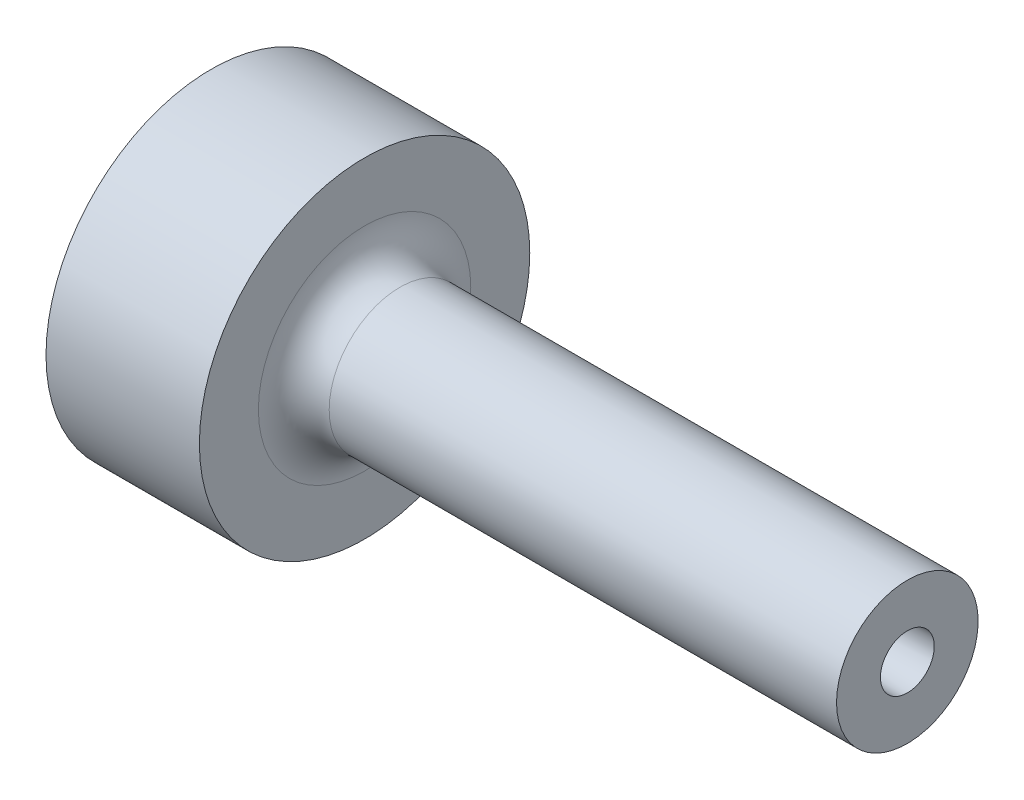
ISO-10303-21;
HEADER;
FILE_DESCRIPTION(('STEP AP214'),'2;1');
FILE_NAME('part.step','',(''),(''),'','','');
FILE_SCHEMA(('AUTOMOTIVE_DESIGN { 1 0 10303 214 1 1 1 1 }'));
ENDSEC;
DATA;
#1=APPLICATION_CONTEXT('core data for automotive mechanical design processes');
#2=APPLICATION_PROTOCOL_DEFINITION('international standard','automotive_design',2000,#1);
#3=PRODUCT_CONTEXT('',#1,'mechanical');
#4=PRODUCT('Part','Part','',(#3));
#5=PRODUCT_RELATED_PRODUCT_CATEGORY('part','',(#4));
#6=PRODUCT_DEFINITION_FORMATION('','',#4);
#7=PRODUCT_DEFINITION_CONTEXT('part definition',#1,'design');
#8=PRODUCT_DEFINITION('design','',#6,#7);
#9=PRODUCT_DEFINITION_SHAPE('','',#8);
#10=(LENGTH_UNIT() NAMED_UNIT(*) SI_UNIT(.MILLI.,.METRE.));
#11=(NAMED_UNIT(*) PLANE_ANGLE_UNIT() SI_UNIT($,.RADIAN.));
#12=(NAMED_UNIT(*) SI_UNIT($,.STERADIAN.) SOLID_ANGLE_UNIT());
#13=UNCERTAINTY_MEASURE_WITH_UNIT(LENGTH_MEASURE(1.E-05),#10,'distance_accuracy_value','');
#14=(GEOMETRIC_REPRESENTATION_CONTEXT(3) GLOBAL_UNCERTAINTY_ASSIGNED_CONTEXT((#13)) GLOBAL_UNIT_ASSIGNED_CONTEXT((#10,
#11,#12)) REPRESENTATION_CONTEXT('',''));
#15=CARTESIAN_POINT('',(0.,0.,0.));
#16=DIRECTION('',(0.,0.,1.));
#17=DIRECTION('',(1.,0.,0.));
#18=AXIS2_PLACEMENT_3D('',#15,#16,#17);
#19=CARTESIAN_POINT('',(0.,0.,0.));
#20=DIRECTION('',(-1.,0.,0.));
#21=DIRECTION('',(0.,0.,1.));
#22=AXIS2_PLACEMENT_3D('',#19,#20,#21);
#23=CYLINDRICAL_SURFACE('',#22,14.);
#24=CARTESIAN_POINT('',(13.,0.,0.));
#25=DIRECTION('',(-1.,0.,0.));
#26=DIRECTION('',(0.,0.,1.));
#27=AXIS2_PLACEMENT_3D('',#24,#25,#26);
#28=CIRCLE('',#27,14.);
#29=CARTESIAN_POINT('',(13.,0.,14.));
#30=VERTEX_POINT('',#29);
#31=EDGE_CURVE('E88',#30,#30,#28,.T.);
#32=ORIENTED_EDGE('',*,*,#31,.T.);
#33=EDGE_LOOP('',(#32));
#34=FACE_BOUND('',#33,.T.);
#35=CARTESIAN_POINT('',(0.,0.,0.));
#36=DIRECTION('',(-1.,0.,0.));
#37=DIRECTION('',(0.,0.,1.));
#38=AXIS2_PLACEMENT_3D('',#35,#36,#37);
#39=CIRCLE('',#38,14.);
#40=CARTESIAN_POINT('',(0.,0.,14.));
#41=VERTEX_POINT('',#40);
#42=EDGE_CURVE('E83',#41,#41,#39,.T.);
#43=ORIENTED_EDGE('',*,*,#42,.F.);
#44=EDGE_LOOP('',(#43));
#45=FACE_BOUND('',#44,.T.);
#46=CARTESIAN_POINT('',(6.5,-13.856406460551,-2.));
#47=CARTESIAN_POINT('',(6.61172417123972,-13.8564082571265,-1.99999534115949));
#48=CARTESIAN_POINT('',(6.72351471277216,-13.8577723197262,-1.99060664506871));
#49=CARTESIAN_POINT('',(6.9439746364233,-13.8630779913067,-1.95330740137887));
#50=CARTESIAN_POINT('',(7.05264079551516,-13.8670221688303,-1.92537839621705));
#51=CARTESIAN_POINT('',(7.26362870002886,-13.8770324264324,-1.85184738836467));
#52=CARTESIAN_POINT('',(7.36595507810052,-13.8830969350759,-1.80625847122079));
#53=CARTESIAN_POINT('',(7.56148972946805,-13.8966626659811,-1.69873175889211));
#54=CARTESIAN_POINT('',(7.65469934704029,-13.9041636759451,-1.63679637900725));
#55=CARTESIAN_POINT('',(7.83004829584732,-13.9198182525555,-1.49785346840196));
#56=CARTESIAN_POINT('',(7.91211171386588,-13.9279757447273,-1.42075056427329));
#57=CARTESIAN_POINT('',(8.06218155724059,-13.9439890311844,-1.25386707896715));
#58=CARTESIAN_POINT('',(8.13018723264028,-13.9518448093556,-1.16408582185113));
#59=CARTESIAN_POINT('',(8.25048909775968,-13.9664103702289,-0.973910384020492));
#60=CARTESIAN_POINT('',(8.30271571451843,-13.9731150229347,-0.873471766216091));
#61=CARTESIAN_POINT('',(8.38953073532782,-13.9845795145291,-0.665136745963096));
#62=CARTESIAN_POINT('',(8.4241199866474,-13.9893394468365,-0.557240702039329));
#63=CARTESIAN_POINT('',(8.47444920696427,-13.9963505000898,-0.337834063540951));
#64=CARTESIAN_POINT('',(8.49031606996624,-13.9986185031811,-0.226353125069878));
#65=CARTESIAN_POINT('',(8.5031438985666,-14.0004479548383,-0.00228956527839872));
#66=CARTESIAN_POINT('',(8.50010582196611,-14.0000095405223,0.110292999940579));
#67=CARTESIAN_POINT('',(8.47531062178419,-13.9964890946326,0.33249899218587));
#68=CARTESIAN_POINT('',(8.45369000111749,-13.9934263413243,0.442137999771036));
#69=CARTESIAN_POINT('',(8.39255744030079,-13.9850228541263,0.656215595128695));
#70=CARTESIAN_POINT('',(8.3530450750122,-13.9796820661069,0.760654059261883));
#71=CARTESIAN_POINT('',(8.25710925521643,-13.9672894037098,0.961781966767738));
#72=CARTESIAN_POINT('',(8.20062784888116,-13.9602316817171,1.05844339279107));
#73=CARTESIAN_POINT('',(8.07239950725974,-13.9451926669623,1.24096782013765));
#74=CARTESIAN_POINT('',(8.00065165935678,-13.9372113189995,1.32683017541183));
#75=CARTESIAN_POINT('',(7.843165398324,-13.921132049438,1.48612299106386));
#76=CARTESIAN_POINT('',(7.75730786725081,-13.9130337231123,1.55943569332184));
#77=CARTESIAN_POINT('',(7.57444547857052,-13.8977029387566,1.69062989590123));
#78=CARTESIAN_POINT('',(7.47744056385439,-13.890470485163,1.74851131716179));
#79=CARTESIAN_POINT('',(7.27491971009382,-13.8776905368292,1.84721301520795));
#80=CARTESIAN_POINT('',(7.1693981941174,-13.8721441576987,1.88802200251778));
#81=CARTESIAN_POINT('',(6.95290242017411,-13.8633846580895,1.9513062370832));
#82=CARTESIAN_POINT('',(6.84192850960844,-13.8601713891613,1.97378265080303));
#83=CARTESIAN_POINT('',(6.61872346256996,-13.8564698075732,1.99960390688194));
#84=CARTESIAN_POINT('',(6.50651197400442,-13.8559577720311,2.00311531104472));
#85=CARTESIAN_POINT('',(6.28310219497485,-13.8576537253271,1.9913480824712));
#86=CARTESIAN_POINT('',(6.17190387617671,-13.8598616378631,1.9760699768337));
#87=CARTESIAN_POINT('',(5.95418781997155,-13.8667269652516,1.92729837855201));
#88=CARTESIAN_POINT('',(5.84765127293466,-13.8713733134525,1.8938871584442));
#89=CARTESIAN_POINT('',(5.6416912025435,-13.8825829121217,1.80988306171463));
#90=CARTESIAN_POINT('',(5.54226800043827,-13.8891462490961,1.75928940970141));
#91=CARTESIAN_POINT('',(5.35260812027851,-13.9035064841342,1.64195360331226));
#92=CARTESIAN_POINT('',(5.26243903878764,-13.911311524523,1.57510320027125));
#93=CARTESIAN_POINT('',(5.09454027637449,-13.9272509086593,1.42730277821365));
#94=CARTESIAN_POINT('',(5.01681123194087,-13.9353852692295,1.34635203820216));
#95=CARTESIAN_POINT('',(4.8754047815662,-13.9511405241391,1.17191708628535));
#96=CARTESIAN_POINT('',(4.81183747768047,-13.9587570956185,1.07834317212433));
#97=CARTESIAN_POINT('',(4.70132443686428,-13.972552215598,0.881748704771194));
#98=CARTESIAN_POINT('',(4.65437828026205,-13.9787308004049,0.778728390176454));
#99=CARTESIAN_POINT('',(4.57861788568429,-13.9889347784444,0.566515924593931));
#100=CARTESIAN_POINT('',(4.54974241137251,-13.9929674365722,0.457345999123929));
#101=CARTESIAN_POINT('',(4.51074453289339,-13.9984555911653,0.235645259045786));
#102=CARTESIAN_POINT('',(4.50062101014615,-13.9999112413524,0.123114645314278));
#103=CARTESIAN_POINT('',(4.49943976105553,-14.0000800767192,-0.101043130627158));
#104=CARTESIAN_POINT('',(4.50821318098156,-13.998817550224,-0.212669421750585));
#105=CARTESIAN_POINT('',(4.54421615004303,-13.9937406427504,-0.432842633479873));
#106=CARTESIAN_POINT('',(4.57144565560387,-13.989926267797,-0.541389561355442));
#107=CARTESIAN_POINT('',(4.6435299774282,-13.9801722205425,-0.752283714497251));
#108=CARTESIAN_POINT('',(4.68837418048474,-13.9742338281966,-0.854634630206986));
#109=CARTESIAN_POINT('',(4.79439714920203,-13.960885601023,-1.05038570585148));
#110=CARTESIAN_POINT('',(4.8555763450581,-13.9534757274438,-1.14378562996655));
#111=CARTESIAN_POINT('',(4.99314771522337,-13.9379304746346,-1.31984194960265));
#112=CARTESIAN_POINT('',(5.06966490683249,-13.9297894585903,-1.40240016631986));
#113=CARTESIAN_POINT('',(5.2354775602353,-13.9137422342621,-1.55356716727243));
#114=CARTESIAN_POINT('',(5.32477602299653,-13.9058360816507,-1.6221726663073));
#115=CARTESIAN_POINT('',(5.51414543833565,-13.8911108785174,-1.74379523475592));
#116=CARTESIAN_POINT('',(5.61426869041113,-13.8842975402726,-1.79673154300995));
#117=CARTESIAN_POINT('',(5.82203229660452,-13.8725962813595,-1.88495902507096));
#118=CARTESIAN_POINT('',(5.92966459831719,-13.8677063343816,-1.92026877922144));
#119=CARTESIAN_POINT('',(6.11483642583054,-13.8615529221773,-1.96409255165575));
#120=CARTESIAN_POINT('',(6.19122433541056,-13.859633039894,-1.97753762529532));
#121=CARTESIAN_POINT('',(6.34506419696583,-13.857059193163,-1.99549291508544));
#122=CARTESIAN_POINT('',(6.42251613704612,-13.8564052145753,-2.00000323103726));
#123=CARTESIAN_POINT('',(6.5,-13.856406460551,-2.));
#124=B_SPLINE_CURVE_WITH_KNOTS('',3,(#46,#47,#48,#49,#50,#51,#52,#53,#54,#55,#56,#57,#58,#59,
#60,#61,#62,#63,#64,#65,#66,#67,#68,#69,#70,#71,#72,#73,#74,#75,#76,#77,#78,#79,#80,#81,#82,#83,
#84,#85,#86,#87,#88,#89,#90,#91,#92,#93,#94,#95,#96,#97,#98,#99,#100,#101,#102,#103,#104,#105,
#106,#107,#108,#109,#110,#111,#112,#113,#114,#115,#116,#117,#118,#119,#120,#121,#122,#123),
.UNSPECIFIED.,.T.,.F.,(4,2,2,2,2,2,2,2,2,2,2,2,2,2,2,2,2,2,2,2,2,2,2,2,2,2,2,2,2,2,2,2,2,2,2,2,
2,2,4),(0.,0.334889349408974,0.670112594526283,1.00508792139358,1.34001378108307,
1.6771171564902,2.01423851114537,2.35282530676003,2.6913958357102,3.02765822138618,
3.36390357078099,3.69769984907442,4.03150405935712,4.36646147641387,4.70143892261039,
5.03940517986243,5.37737316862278,5.7155642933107,6.05373389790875,6.3889286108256,
6.72411392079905,7.05779100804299,7.39148315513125,7.72746121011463,8.06345644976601,
8.40197921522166,8.74049343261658,9.07785422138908,9.41519488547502,9.74953375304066,
10.083871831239,10.4180087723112,10.7521545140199,11.0891434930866,11.426211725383,
11.7649881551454,12.103406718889,12.3356645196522,12.5679197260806),.UNSPECIFIED.);
#125=CARTESIAN_POINT('',(6.5,-13.856406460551,-2.));
#126=VERTEX_POINT('',#125);
#127=EDGE_CURVE('E9',#126,#126,#124,.T.);
#128=ORIENTED_EDGE('',*,*,#127,.F.);
#129=EDGE_LOOP('',(#128));
#130=FACE_BOUND('',#129,.T.);
#131=ADVANCED_FACE('F15',(#34,#45,#130),#23,.T.);
#132=CARTESIAN_POINT('',(0.,0.,0.));
#133=DIRECTION('',(1.,0.,0.));
#134=DIRECTION('',(0.,0.,-1.));
#135=AXIS2_PLACEMENT_3D('',#132,#133,#134);
#136=CONICAL_SURFACE('',#135,1.25,0.0174532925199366);
#137=CARTESIAN_POINT('',(59.,0.,0.));
#138=DIRECTION('',(-1.,0.,0.));
#139=DIRECTION('',(0.,0.,1.));
#140=AXIS2_PLACEMENT_3D('',#137,#138,#139);
#141=CIRCLE('',#140,2.27984883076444);
#142=CARTESIAN_POINT('',(59.,0.,2.27984883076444));
#143=VERTEX_POINT('',#142);
#144=EDGE_CURVE('E80',#143,#143,#141,.T.);
#145=ORIENTED_EDGE('',*,*,#144,.F.);
#146=EDGE_LOOP('',(#145));
#147=FACE_BOUND('',#146,.T.);
#148=CARTESIAN_POINT('',(1.22738614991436,0.,0.));
#149=DIRECTION('',(-1.,0.,0.));
#150=DIRECTION('',(0.,0.,1.));
#151=AXIS2_PLACEMENT_3D('',#148,#149,#150);
#152=CIRCLE('',#151,1.27142410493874);
#153=CARTESIAN_POINT('',(1.22738614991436,0.,1.27142410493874));
#154=VERTEX_POINT('',#153);
#155=EDGE_CURVE('E93',#154,#154,#152,.F.);
#156=ORIENTED_EDGE('',*,*,#155,.F.);
#157=EDGE_LOOP('',(#156));
#158=FACE_BOUND('',#157,.T.);
#159=ADVANCED_FACE('F44',(#147,#158),#136,.F.);
#160=CARTESIAN_POINT('',(16.,0.,0.));
#161=DIRECTION('',(-1.,0.,0.));
#162=DIRECTION('',(0.,0.,1.));
#163=AXIS2_PLACEMENT_3D('',#160,#161,#162);
#164=TOROIDAL_SURFACE('',#163,9.,3.);
#165=CARTESIAN_POINT('',(13.,0.,0.));
#166=DIRECTION('',(-1.,0.,0.));
#167=DIRECTION('',(0.,0.,1.));
#168=AXIS2_PLACEMENT_3D('',#165,#166,#167);
#169=CIRCLE('',#168,9.);
#170=CARTESIAN_POINT('',(13.,0.,9.));
#171=VERTEX_POINT('',#170);
#172=EDGE_CURVE('E90',#171,#171,#169,.T.);
#173=ORIENTED_EDGE('',*,*,#172,.F.);
#174=EDGE_LOOP('',(#173));
#175=FACE_BOUND('',#174,.T.);
#176=CARTESIAN_POINT('',(16.,0.,0.));
#177=DIRECTION('',(-1.,0.,0.));
#178=DIRECTION('',(0.,0.,1.));
#179=AXIS2_PLACEMENT_3D('',#176,#177,#178);
#180=CIRCLE('',#179,6.);
#181=CARTESIAN_POINT('',(16.,0.,6.));
#182=VERTEX_POINT('',#181);
#183=EDGE_CURVE('E27',#182,#182,#180,.T.);
#184=ORIENTED_EDGE('',*,*,#183,.T.);
#185=EDGE_LOOP('',(#184));
#186=FACE_BOUND('',#185,.T.);
#187=ADVANCED_FACE('F17',(#175,#186),#164,.F.);
#188=CARTESIAN_POINT('',(0.,0.,0.));
#189=DIRECTION('',(-1.,0.,0.));
#190=DIRECTION('',(0.,0.,1.));
#191=AXIS2_PLACEMENT_3D('',#188,#189,#190);
#192=CYLINDRICAL_SURFACE('',#191,6.);
#193=ORIENTED_EDGE('',*,*,#183,.F.);
#194=EDGE_LOOP('',(#193));
#195=FACE_BOUND('',#194,.T.);
#196=CARTESIAN_POINT('',(59.,0.,0.));
#197=DIRECTION('',(-1.,0.,0.));
#198=DIRECTION('',(0.,0.,1.));
#199=AXIS2_PLACEMENT_3D('',#196,#197,#198);
#200=CIRCLE('',#199,6.);
#201=CARTESIAN_POINT('',(59.,0.,6.));
#202=VERTEX_POINT('',#201);
#203=EDGE_CURVE('E79',#202,#202,#200,.T.);
#204=ORIENTED_EDGE('',*,*,#203,.T.);
#205=EDGE_LOOP('',(#204));
#206=FACE_BOUND('',#205,.T.);
#207=ADVANCED_FACE('F65',(#195,#206),#192,.T.);
#208=CARTESIAN_POINT('',(59.,6.,0.));
#209=DIRECTION('',(-1.,0.,0.));
#210=DIRECTION('',(0.,0.,1.));
#211=AXIS2_PLACEMENT_3D('',#208,#209,#210);
#212=PLANE('',#211);
#213=ORIENTED_EDGE('',*,*,#203,.F.);
#214=EDGE_LOOP('',(#213));
#215=FACE_BOUND('',#214,.T.);
#216=ORIENTED_EDGE('',*,*,#144,.T.);
#217=EDGE_LOOP('',(#216));
#218=FACE_BOUND('',#217,.T.);
#219=ADVANCED_FACE('F61',(#215,#218),#212,.F.);
#220=CARTESIAN_POINT('',(0.,1.25,0.));
#221=DIRECTION('',(1.,0.,0.));
#222=DIRECTION('',(0.,0.,-1.));
#223=AXIS2_PLACEMENT_3D('',#220,#221,#222);
#224=PLANE('',#223);
#225=CARTESIAN_POINT('',(0.,0.,0.));
#226=DIRECTION('',(-1.,0.,0.));
#227=DIRECTION('',(0.,0.,1.));
#228=AXIS2_PLACEMENT_3D('',#225,#226,#227);
#229=CIRCLE('',#228,5.);
#230=CARTESIAN_POINT('',(0.,0.,5.));
#231=VERTEX_POINT('',#230);
#232=EDGE_CURVE('E96',#231,#231,#229,.T.);
#233=ORIENTED_EDGE('',*,*,#232,.F.);
#234=EDGE_LOOP('',(#233));
#235=FACE_BOUND('',#234,.T.);
#236=ORIENTED_EDGE('',*,*,#42,.T.);
#237=EDGE_LOOP('',(#236));
#238=FACE_BOUND('',#237,.T.);
#239=ADVANCED_FACE('F59',(#235,#238),#224,.F.);
#240=CARTESIAN_POINT('',(13.,14.,0.));
#241=DIRECTION('',(-1.,0.,0.));
#242=DIRECTION('',(0.,0.,1.));
#243=AXIS2_PLACEMENT_3D('',#240,#241,#242);
#244=PLANE('',#243);
#245=ORIENTED_EDGE('',*,*,#31,.F.);
#246=EDGE_LOOP('',(#245));
#247=FACE_BOUND('',#246,.T.);
#248=ORIENTED_EDGE('',*,*,#172,.T.);
#249=EDGE_LOOP('',(#248));
#250=FACE_BOUND('',#249,.T.);
#251=ADVANCED_FACE('F57',(#247,#250),#244,.F.);
#252=CARTESIAN_POINT('',(-37.3349076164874,0.,0.));
#253=DIRECTION('',(-1.,0.,0.));
#254=DIRECTION('',(0.,0.,1.));
#255=AXIS2_PLACEMENT_3D('',#252,#253,#254);
#256=DEGENERATE_TOROIDAL_SURFACE('',#255,9.35634609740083,40.,.F.);
#257=ORIENTED_EDGE('',*,*,#232,.T.);
#258=EDGE_LOOP('',(#257));
#259=FACE_BOUND('',#258,.T.);
#260=ORIENTED_EDGE('',*,*,#155,.T.);
#261=EDGE_LOOP('',(#260));
#262=FACE_BOUND('',#261,.T.);
#263=ADVANCED_FACE('F40',(#259,#262),#256,.T.);
#264=CARTESIAN_POINT('',(6.5,-14.,0.));
#265=DIRECTION('',(0.,-1.,0.));
#266=DIRECTION('',(0.,0.,-1.));
#267=AXIS2_PLACEMENT_3D('',#264,#265,#266);
#268=CYLINDRICAL_SURFACE('',#267,2.);
#269=CARTESIAN_POINT('',(6.5,-8.,0.));
#270=DIRECTION('',(0.,-1.,0.));
#271=DIRECTION('',(0.,0.,-1.));
#272=AXIS2_PLACEMENT_3D('',#269,#270,#271);
#273=CIRCLE('',#272,2.);
#274=CARTESIAN_POINT('',(6.5,-8.,-2.));
#275=VERTEX_POINT('',#274);
#276=EDGE_CURVE('E99',#275,#275,#273,.T.);
#277=ORIENTED_EDGE('',*,*,#276,.F.);
#278=EDGE_LOOP('',(#277));
#279=FACE_BOUND('',#278,.T.);
#280=ORIENTED_EDGE('',*,*,#127,.T.);
#281=EDGE_LOOP('',(#280));
#282=FACE_BOUND('',#281,.T.);
#283=ADVANCED_FACE('F32',(#279,#282),#268,.F.);
#284=CARTESIAN_POINT('',(6.5,-6.84529946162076,0.));
#285=DIRECTION('',(0.,-1.,0.));
#286=DIRECTION('',(0.,0.,-1.));
#287=AXIS2_PLACEMENT_3D('',#284,#285,#286);
#288=CONICAL_SURFACE('',#287,0.,1.0471975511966);
#289=ORIENTED_EDGE('',*,*,#276,.T.);
#290=EDGE_LOOP('',(#289));
#291=FACE_BOUND('',#290,.T.);
#292=CARTESIAN_POINT('',(6.5,-6.84529946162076,0.));
#293=VERTEX_POINT('',#292);
#294=VERTEX_LOOP('',#293);
#295=FACE_BOUND('',#294,.T.);
#296=ADVANCED_FACE('F30',(#291,#295),#288,.F.);
#297=CLOSED_SHELL('',(#131,#159,#187,#207,#219,#239,#251,#263,#283,#296));
#298=MANIFOLD_SOLID_BREP('B1',#297);
#299=ADVANCED_BREP_SHAPE_REPRESENTATION('',(#18,#298),#14);
#300=SHAPE_DEFINITION_REPRESENTATION(#9,#299);
ENDSEC;
END-ISO-10303-21;
